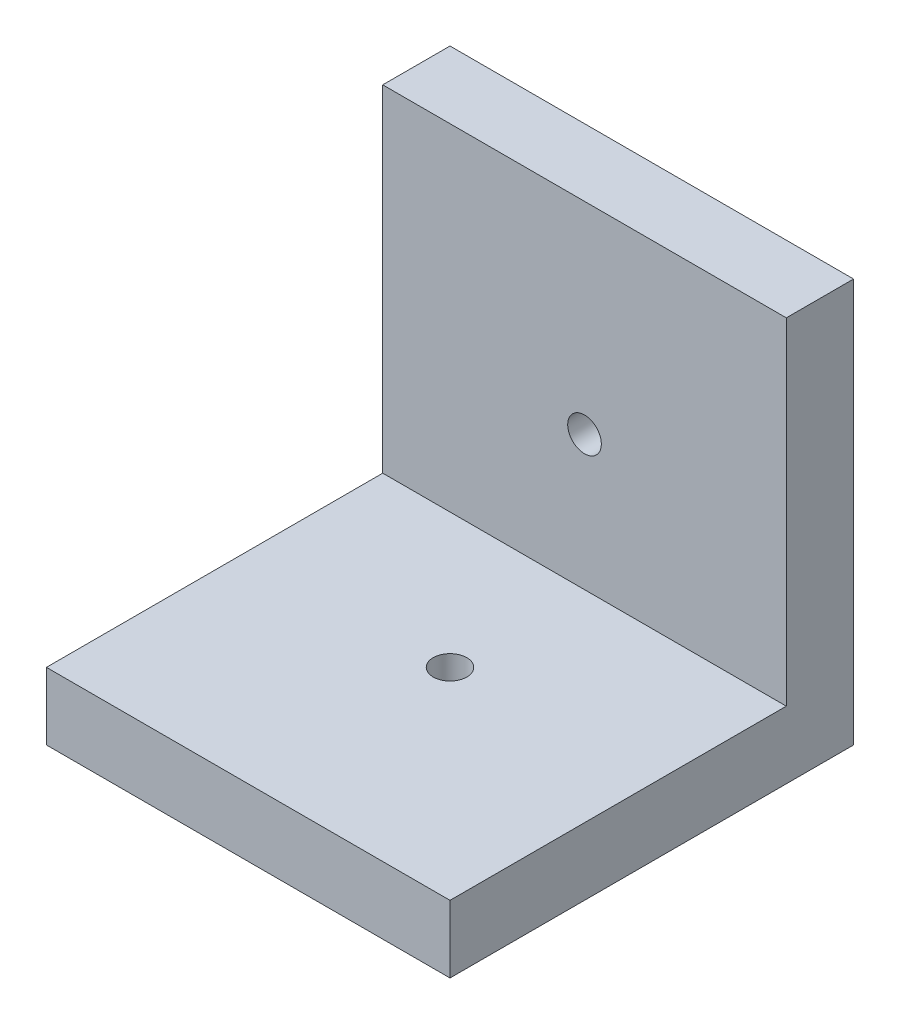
ISO-10303-21;
HEADER;
FILE_DESCRIPTION(('STEP AP214'),'2;1');
FILE_NAME('part.step','',(''),(''),'','','');
FILE_SCHEMA(('AUTOMOTIVE_DESIGN { 1 0 10303 214 1 1 1 1 }'));
ENDSEC;
DATA;
#1=APPLICATION_CONTEXT('core data for automotive mechanical design processes');
#2=APPLICATION_PROTOCOL_DEFINITION('international standard','automotive_design',2000,#1);
#3=PRODUCT_CONTEXT('',#1,'mechanical');
#4=PRODUCT('Part','Part','',(#3));
#5=PRODUCT_RELATED_PRODUCT_CATEGORY('part','',(#4));
#6=PRODUCT_DEFINITION_FORMATION('','',#4);
#7=PRODUCT_DEFINITION_CONTEXT('part definition',#1,'design');
#8=PRODUCT_DEFINITION('design','',#6,#7);
#9=PRODUCT_DEFINITION_SHAPE('','',#8);
#10=(LENGTH_UNIT() NAMED_UNIT(*) SI_UNIT(.MILLI.,.METRE.));
#11=(NAMED_UNIT(*) PLANE_ANGLE_UNIT() SI_UNIT($,.RADIAN.));
#12=(NAMED_UNIT(*) SI_UNIT($,.STERADIAN.) SOLID_ANGLE_UNIT());
#13=UNCERTAINTY_MEASURE_WITH_UNIT(LENGTH_MEASURE(1.E-05),#10,'distance_accuracy_value','');
#14=(GEOMETRIC_REPRESENTATION_CONTEXT(3) GLOBAL_UNCERTAINTY_ASSIGNED_CONTEXT((#13)) GLOBAL_UNIT_ASSIGNED_CONTEXT((#10,
#11,#12)) REPRESENTATION_CONTEXT('',''));
#15=CARTESIAN_POINT('',(0.,0.,0.));
#16=DIRECTION('',(0.,0.,1.));
#17=DIRECTION('',(1.,0.,0.));
#18=AXIS2_PLACEMENT_3D('',#15,#16,#17);
#19=CARTESIAN_POINT('',(0.,0.,6.35));
#20=DIRECTION('',(0.,0.,1.));
#21=DIRECTION('',(1.,0.,0.));
#22=AXIS2_PLACEMENT_3D('',#19,#20,#21);
#23=PLANE('',#22);
#24=DIRECTION('',(-1.,0.,0.));
#25=VECTOR('',#24,1.);
#26=CARTESIAN_POINT('',(-19.05,-12.7,6.35));
#27=LINE('',#26,#25);
#28=CARTESIAN_POINT('',(19.05,-12.7,6.35));
#29=VERTEX_POINT('',#28);
#30=CARTESIAN_POINT('',(-19.05,-12.7,6.35));
#31=VERTEX_POINT('',#30);
#32=EDGE_CURVE('E56',#29,#31,#27,.T.);
#33=ORIENTED_EDGE('',*,*,#32,.F.);
#34=DIRECTION('',(0.,1.,0.));
#35=VECTOR('',#34,1.);
#36=CARTESIAN_POINT('',(19.05,-19.05,6.35));
#37=LINE('',#36,#35);
#38=CARTESIAN_POINT('',(19.05,19.05,6.35));
#39=VERTEX_POINT('',#38);
#40=EDGE_CURVE('E169',#29,#39,#37,.T.);
#41=ORIENTED_EDGE('',*,*,#40,.T.);
#42=DIRECTION('',(-1.,0.,0.));
#43=VECTOR('',#42,1.);
#44=CARTESIAN_POINT('',(19.05,19.05,6.35));
#45=LINE('',#44,#43);
#46=CARTESIAN_POINT('',(-19.05,19.05,6.35));
#47=VERTEX_POINT('',#46);
#48=EDGE_CURVE('E62',#39,#47,#45,.T.);
#49=ORIENTED_EDGE('',*,*,#48,.T.);
#50=DIRECTION('',(0.,-1.,0.));
#51=VECTOR('',#50,1.);
#52=CARTESIAN_POINT('',(-19.05,-19.05,6.35));
#53=LINE('',#52,#51);
#54=EDGE_CURVE('E92',#47,#31,#53,.T.);
#55=ORIENTED_EDGE('',*,*,#54,.T.);
#56=EDGE_LOOP('',(#33,#41,#49,#55));
#57=FACE_BOUND('',#56,.T.);
#58=CARTESIAN_POINT('',(0.,0.,6.35));
#59=DIRECTION('',(0.,0.,1.));
#60=DIRECTION('',(1.,0.,0.));
#61=AXIS2_PLACEMENT_3D('',#58,#59,#60);
#62=CIRCLE('',#61,1.5875);
#63=CARTESIAN_POINT('',(1.5875,0.,6.35));
#64=VERTEX_POINT('',#63);
#65=EDGE_CURVE('E106',#64,#64,#62,.T.);
#66=ORIENTED_EDGE('',*,*,#65,.F.);
#67=EDGE_LOOP('',(#66));
#68=FACE_BOUND('',#67,.T.);
#69=ADVANCED_FACE('F39',(#57,#68),#23,.T.);
#70=CARTESIAN_POINT('',(0.,0.,0.));
#71=DIRECTION('',(0.,0.,1.));
#72=DIRECTION('',(1.,0.,0.));
#73=AXIS2_PLACEMENT_3D('',#70,#71,#72);
#74=PLANE('',#73);
#75=DIRECTION('',(0.,-1.,0.));
#76=VECTOR('',#75,1.);
#77=CARTESIAN_POINT('',(-19.05,-19.05,0.));
#78=LINE('',#77,#76);
#79=CARTESIAN_POINT('',(-19.05,19.05,0.));
#80=VERTEX_POINT('',#79);
#81=CARTESIAN_POINT('',(-19.05,-19.05,0.));
#82=VERTEX_POINT('',#81);
#83=EDGE_CURVE('E98',#80,#82,#78,.T.);
#84=ORIENTED_EDGE('',*,*,#83,.F.);
#85=DIRECTION('',(-1.,0.,0.));
#86=VECTOR('',#85,1.);
#87=CARTESIAN_POINT('',(19.05,19.05,0.));
#88=LINE('',#87,#86);
#89=CARTESIAN_POINT('',(19.05,19.05,0.));
#90=VERTEX_POINT('',#89);
#91=EDGE_CURVE('E81',#90,#80,#88,.T.);
#92=ORIENTED_EDGE('',*,*,#91,.F.);
#93=DIRECTION('',(0.,1.,0.));
#94=VECTOR('',#93,1.);
#95=CARTESIAN_POINT('',(19.05,-19.05,0.));
#96=LINE('',#95,#94);
#97=CARTESIAN_POINT('',(19.05,-19.05,0.));
#98=VERTEX_POINT('',#97);
#99=EDGE_CURVE('E93',#98,#90,#96,.T.);
#100=ORIENTED_EDGE('',*,*,#99,.F.);
#101=DIRECTION('',(1.,0.,0.));
#102=VECTOR('',#101,1.);
#103=CARTESIAN_POINT('',(19.05,-19.05,0.));
#104=LINE('',#103,#102);
#105=EDGE_CURVE('E104',#82,#98,#104,.T.);
#106=ORIENTED_EDGE('',*,*,#105,.F.);
#107=EDGE_LOOP('',(#84,#92,#100,#106));
#108=FACE_BOUND('',#107,.T.);
#109=CARTESIAN_POINT('',(0.,0.,0.));
#110=DIRECTION('',(0.,0.,1.));
#111=DIRECTION('',(1.,0.,0.));
#112=AXIS2_PLACEMENT_3D('',#109,#110,#111);
#113=CIRCLE('',#112,1.5875);
#114=CARTESIAN_POINT('',(1.5875,0.,0.));
#115=VERTEX_POINT('',#114);
#116=EDGE_CURVE('E112',#115,#115,#113,.T.);
#117=ORIENTED_EDGE('',*,*,#116,.T.);
#118=EDGE_LOOP('',(#117));
#119=FACE_BOUND('',#118,.T.);
#120=ADVANCED_FACE('F102',(#108,#119),#74,.F.);
#121=CARTESIAN_POINT('',(-19.05,-19.05,6.35));
#122=DIRECTION('',(1.,0.,0.));
#123=DIRECTION('',(0.,0.,-1.));
#124=AXIS2_PLACEMENT_3D('',#121,#122,#123);
#125=PLANE('',#124);
#126=ORIENTED_EDGE('',*,*,#83,.T.);
#127=DIRECTION('',(0.,0.,-1.));
#128=VECTOR('',#127,1.);
#129=CARTESIAN_POINT('',(-19.05,-19.05,6.35));
#130=LINE('',#129,#128);
#131=CARTESIAN_POINT('',(-19.05,-19.05,38.1));
#132=VERTEX_POINT('',#131);
#133=EDGE_CURVE('E11',#132,#82,#130,.T.);
#134=ORIENTED_EDGE('',*,*,#133,.F.);
#135=DIRECTION('',(0.,-1.,0.));
#136=VECTOR('',#135,1.);
#137=CARTESIAN_POINT('',(-19.05,-12.7,38.1));
#138=LINE('',#137,#136);
#139=CARTESIAN_POINT('',(-19.05,-12.7,38.1));
#140=VERTEX_POINT('',#139);
#141=EDGE_CURVE('E144',#140,#132,#138,.T.);
#142=ORIENTED_EDGE('',*,*,#141,.F.);
#143=DIRECTION('',(0.,0.,-1.));
#144=VECTOR('',#143,1.);
#145=CARTESIAN_POINT('',(-19.05,-12.7,38.1));
#146=LINE('',#145,#144);
#147=EDGE_CURVE('E156',#140,#31,#146,.T.);
#148=ORIENTED_EDGE('',*,*,#147,.T.);
#149=ORIENTED_EDGE('',*,*,#54,.F.);
#150=DIRECTION('',(0.,0.,-1.));
#151=VECTOR('',#150,1.);
#152=CARTESIAN_POINT('',(-19.05,19.05,6.35));
#153=LINE('',#152,#151);
#154=EDGE_CURVE('E84',#47,#80,#153,.T.);
#155=ORIENTED_EDGE('',*,*,#154,.T.);
#156=EDGE_LOOP('',(#126,#134,#142,#148,#149,#155));
#157=FACE_BOUND('',#156,.T.);
#158=ADVANCED_FACE('F41',(#157),#125,.F.);
#159=CARTESIAN_POINT('',(19.05,-19.05,6.35));
#160=DIRECTION('',(0.,1.,0.));
#161=DIRECTION('',(0.,0.,1.));
#162=AXIS2_PLACEMENT_3D('',#159,#160,#161);
#163=PLANE('',#162);
#164=CARTESIAN_POINT('',(0.,-19.05,19.05));
#165=DIRECTION('',(0.,-1.,0.));
#166=DIRECTION('',(0.,0.,-1.));
#167=AXIS2_PLACEMENT_3D('',#164,#165,#166);
#168=CIRCLE('',#167,1.5875);
#169=CARTESIAN_POINT('',(0.,-19.05,17.4625));
#170=VERTEX_POINT('',#169);
#171=EDGE_CURVE('E211',#170,#170,#168,.T.);
#172=ORIENTED_EDGE('',*,*,#171,.F.);
#173=EDGE_LOOP('',(#172));
#174=FACE_BOUND('',#173,.T.);
#175=ORIENTED_EDGE('',*,*,#105,.T.);
#176=DIRECTION('',(0.,0.,-1.));
#177=VECTOR('',#176,1.);
#178=CARTESIAN_POINT('',(19.05,-19.05,6.35));
#179=LINE('',#178,#177);
#180=CARTESIAN_POINT('',(19.05,-19.05,38.1));
#181=VERTEX_POINT('',#180);
#182=EDGE_CURVE('E49',#181,#98,#179,.T.);
#183=ORIENTED_EDGE('',*,*,#182,.F.);
#184=DIRECTION('',(1.,0.,0.));
#185=VECTOR('',#184,1.);
#186=CARTESIAN_POINT('',(-19.05,-19.05,38.1));
#187=LINE('',#186,#185);
#188=EDGE_CURVE('E136',#132,#181,#187,.T.);
#189=ORIENTED_EDGE('',*,*,#188,.F.);
#190=ORIENTED_EDGE('',*,*,#133,.T.);
#191=EDGE_LOOP('',(#175,#183,#189,#190));
#192=FACE_BOUND('',#191,.T.);
#193=ADVANCED_FACE('F134',(#174,#192),#163,.F.);
#194=CARTESIAN_POINT('',(19.05,-19.05,6.35));
#195=DIRECTION('',(-1.,0.,0.));
#196=DIRECTION('',(0.,0.,1.));
#197=AXIS2_PLACEMENT_3D('',#194,#195,#196);
#198=PLANE('',#197);
#199=ORIENTED_EDGE('',*,*,#99,.T.);
#200=DIRECTION('',(0.,0.,-1.));
#201=VECTOR('',#200,1.);
#202=CARTESIAN_POINT('',(19.05,19.05,6.35));
#203=LINE('',#202,#201);
#204=EDGE_CURVE('E87',#39,#90,#203,.T.);
#205=ORIENTED_EDGE('',*,*,#204,.F.);
#206=ORIENTED_EDGE('',*,*,#40,.F.);
#207=DIRECTION('',(0.,0.,-1.));
#208=VECTOR('',#207,1.);
#209=CARTESIAN_POINT('',(19.05,-12.7,38.1));
#210=LINE('',#209,#208);
#211=CARTESIAN_POINT('',(19.05,-12.7,38.1));
#212=VERTEX_POINT('',#211);
#213=EDGE_CURVE('E161',#212,#29,#210,.T.);
#214=ORIENTED_EDGE('',*,*,#213,.F.);
#215=DIRECTION('',(0.,1.,0.));
#216=VECTOR('',#215,1.);
#217=CARTESIAN_POINT('',(19.05,-12.7,38.1));
#218=LINE('',#217,#216);
#219=EDGE_CURVE('E130',#181,#212,#218,.T.);
#220=ORIENTED_EDGE('',*,*,#219,.F.);
#221=ORIENTED_EDGE('',*,*,#182,.T.);
#222=EDGE_LOOP('',(#199,#205,#206,#214,#220,#221));
#223=FACE_BOUND('',#222,.T.);
#224=ADVANCED_FACE('F126',(#223),#198,.F.);
#225=CARTESIAN_POINT('',(19.05,19.05,6.35));
#226=DIRECTION('',(0.,-1.,0.));
#227=DIRECTION('',(0.,0.,-1.));
#228=AXIS2_PLACEMENT_3D('',#225,#226,#227);
#229=PLANE('',#228);
#230=ORIENTED_EDGE('',*,*,#91,.T.);
#231=ORIENTED_EDGE('',*,*,#154,.F.);
#232=ORIENTED_EDGE('',*,*,#48,.F.);
#233=ORIENTED_EDGE('',*,*,#204,.T.);
#234=EDGE_LOOP('',(#230,#231,#232,#233));
#235=FACE_BOUND('',#234,.T.);
#236=ADVANCED_FACE('F83',(#235),#229,.F.);
#237=CARTESIAN_POINT('',(0.,0.,6.35));
#238=DIRECTION('',(0.,0.,-1.));
#239=DIRECTION('',(-1.,0.,0.));
#240=AXIS2_PLACEMENT_3D('',#237,#238,#239);
#241=CYLINDRICAL_SURFACE('',#240,1.5875);
#242=ORIENTED_EDGE('',*,*,#65,.T.);
#243=EDGE_LOOP('',(#242));
#244=FACE_BOUND('',#243,.T.);
#245=ORIENTED_EDGE('',*,*,#116,.F.);
#246=EDGE_LOOP('',(#245));
#247=FACE_BOUND('',#246,.T.);
#248=ADVANCED_FACE('F182',(#244,#247),#241,.F.);
#249=CARTESIAN_POINT('',(-19.05,-12.7,38.1));
#250=DIRECTION('',(0.,-1.,0.));
#251=DIRECTION('',(1.,0.,0.));
#252=AXIS2_PLACEMENT_3D('',#249,#250,#251);
#253=PLANE('',#252);
#254=CARTESIAN_POINT('',(0.,-12.7,19.05));
#255=DIRECTION('',(0.,-1.,0.));
#256=DIRECTION('',(1.,0.,0.));
#257=AXIS2_PLACEMENT_3D('',#254,#255,#256);
#258=CIRCLE('',#257,1.5875);
#259=CARTESIAN_POINT('',(1.5875,-12.7,19.05));
#260=VERTEX_POINT('',#259);
#261=EDGE_CURVE('E43',#260,#260,#258,.T.);
#262=ORIENTED_EDGE('',*,*,#261,.T.);
#263=EDGE_LOOP('',(#262));
#264=FACE_BOUND('',#263,.T.);
#265=ORIENTED_EDGE('',*,*,#32,.T.);
#266=ORIENTED_EDGE('',*,*,#147,.F.);
#267=DIRECTION('',(-1.,0.,0.));
#268=VECTOR('',#267,1.);
#269=CARTESIAN_POINT('',(-19.05,-12.7,38.1));
#270=LINE('',#269,#268);
#271=EDGE_CURVE('E149',#212,#140,#270,.T.);
#272=ORIENTED_EDGE('',*,*,#271,.F.);
#273=ORIENTED_EDGE('',*,*,#213,.T.);
#274=EDGE_LOOP('',(#265,#266,#272,#273));
#275=FACE_BOUND('',#274,.T.);
#276=ADVANCED_FACE('F175',(#264,#275),#253,.F.);
#277=CARTESIAN_POINT('',(0.,0.,38.1));
#278=DIRECTION('',(0.,0.,1.));
#279=DIRECTION('',(1.,0.,0.));
#280=AXIS2_PLACEMENT_3D('',#277,#278,#279);
#281=PLANE('',#280);
#282=ORIENTED_EDGE('',*,*,#141,.T.);
#283=ORIENTED_EDGE('',*,*,#188,.T.);
#284=ORIENTED_EDGE('',*,*,#219,.T.);
#285=ORIENTED_EDGE('',*,*,#271,.T.);
#286=EDGE_LOOP('',(#282,#283,#284,#285));
#287=FACE_BOUND('',#286,.T.);
#288=ADVANCED_FACE('F141',(#287),#281,.T.);
#289=CARTESIAN_POINT('',(0.,12.7,19.05));
#290=DIRECTION('',(0.,-1.,0.));
#291=DIRECTION('',(0.,0.,-1.));
#292=AXIS2_PLACEMENT_3D('',#289,#290,#291);
#293=CYLINDRICAL_SURFACE('',#292,1.5875);
#294=ORIENTED_EDGE('',*,*,#171,.T.);
#295=EDGE_LOOP('',(#294));
#296=FACE_BOUND('',#295,.T.);
#297=ORIENTED_EDGE('',*,*,#261,.F.);
#298=EDGE_LOOP('',(#297));
#299=FACE_BOUND('',#298,.T.);
#300=ADVANCED_FACE('F189',(#296,#299),#293,.F.);
#301=CLOSED_SHELL('',(#69,#120,#158,#193,#224,#236,#248,#276,#288,#300));
#302=MANIFOLD_SOLID_BREP('B2',#301);
#303=ADVANCED_BREP_SHAPE_REPRESENTATION('',(#18,#302),#14);
#304=SHAPE_DEFINITION_REPRESENTATION(#9,#303);
ENDSEC;
END-ISO-10303-21;
